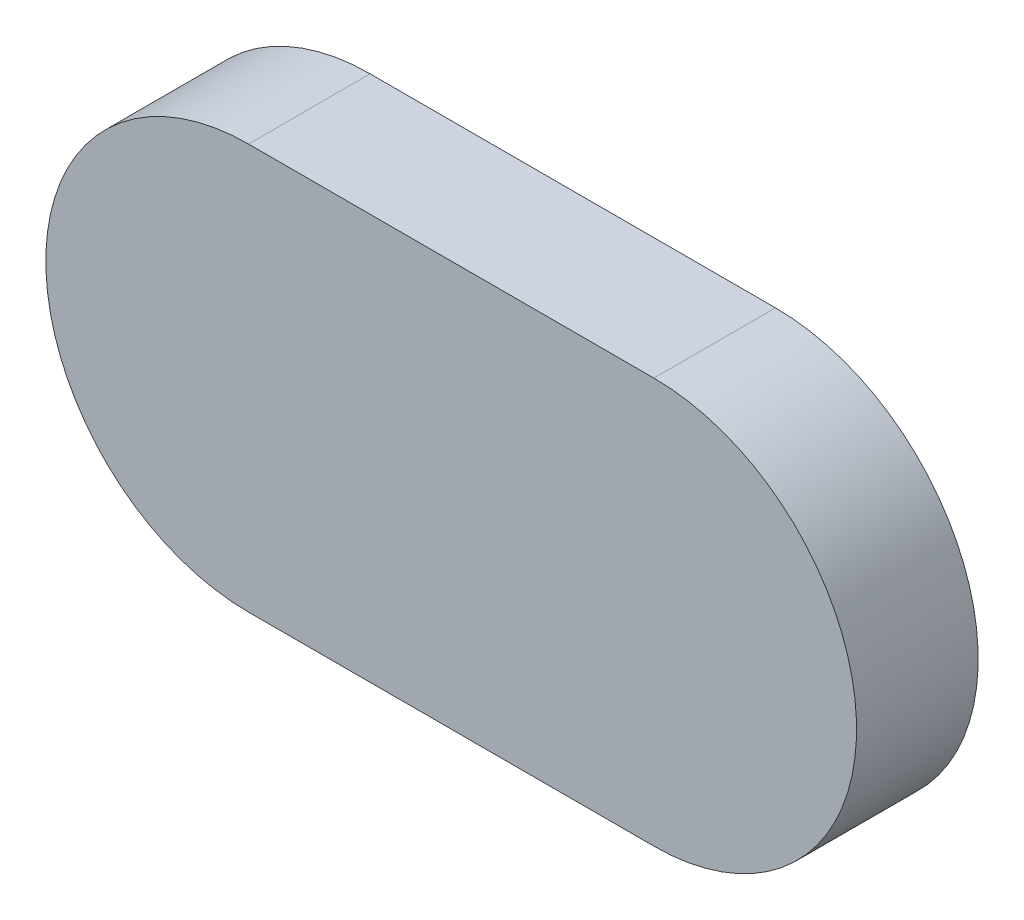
ISO-10303-21;
HEADER;
FILE_DESCRIPTION(('STEP AP214'),'2;1');
FILE_NAME('part.step','',(''),(''),'','','');
FILE_SCHEMA(('AUTOMOTIVE_DESIGN { 1 0 10303 214 1 1 1 1 }'));
ENDSEC;
DATA;
#1=APPLICATION_CONTEXT('core data for automotive mechanical design processes');
#2=APPLICATION_PROTOCOL_DEFINITION('international standard','automotive_design',2000,#1);
#3=PRODUCT_CONTEXT('',#1,'mechanical');
#4=PRODUCT('Part','Part','',(#3));
#5=PRODUCT_RELATED_PRODUCT_CATEGORY('part','',(#4));
#6=PRODUCT_DEFINITION_FORMATION('','',#4);
#7=PRODUCT_DEFINITION_CONTEXT('part definition',#1,'design');
#8=PRODUCT_DEFINITION('design','',#6,#7);
#9=PRODUCT_DEFINITION_SHAPE('','',#8);
#10=(LENGTH_UNIT() NAMED_UNIT(*) SI_UNIT(.MILLI.,.METRE.));
#11=(NAMED_UNIT(*) PLANE_ANGLE_UNIT() SI_UNIT($,.RADIAN.));
#12=(NAMED_UNIT(*) SI_UNIT($,.STERADIAN.) SOLID_ANGLE_UNIT());
#13=UNCERTAINTY_MEASURE_WITH_UNIT(LENGTH_MEASURE(1.E-05),#10,'distance_accuracy_value','');
#14=(GEOMETRIC_REPRESENTATION_CONTEXT(3) GLOBAL_UNCERTAINTY_ASSIGNED_CONTEXT((#13)) GLOBAL_UNIT_ASSIGNED_CONTEXT((#10,
#11,#12)) REPRESENTATION_CONTEXT('',''));
#15=CARTESIAN_POINT('',(0.,0.,0.));
#16=DIRECTION('',(0.,0.,1.));
#17=DIRECTION('',(1.,0.,0.));
#18=AXIS2_PLACEMENT_3D('',#15,#16,#17);
#19=CARTESIAN_POINT('',(0.,0.,1.5));
#20=DIRECTION('',(0.,0.,-1.));
#21=DIRECTION('',(-1.,0.,0.));
#22=AXIS2_PLACEMENT_3D('',#19,#20,#21);
#23=CYLINDRICAL_SURFACE('',#22,2.5);
#24=CARTESIAN_POINT('',(0.,0.,0.));
#25=DIRECTION('',(0.,0.,1.));
#26=DIRECTION('',(1.,0.,0.));
#27=AXIS2_PLACEMENT_3D('',#24,#25,#26);
#28=CIRCLE('',#27,2.5);
#29=CARTESIAN_POINT('',(0.,2.5,0.));
#30=VERTEX_POINT('',#29);
#31=CARTESIAN_POINT('',(0.,-2.5,0.));
#32=VERTEX_POINT('',#31);
#33=EDGE_CURVE('E106',#30,#32,#28,.T.);
#34=ORIENTED_EDGE('',*,*,#33,.T.);
#35=DIRECTION('',(0.,0.,-1.));
#36=VECTOR('',#35,1.);
#37=CARTESIAN_POINT('',(0.,-2.5,1.5));
#38=LINE('',#37,#36);
#39=CARTESIAN_POINT('',(0.,-2.5,1.5));
#40=VERTEX_POINT('',#39);
#41=EDGE_CURVE('E11',#40,#32,#38,.T.);
#42=ORIENTED_EDGE('',*,*,#41,.F.);
#43=CARTESIAN_POINT('',(0.,0.,1.5));
#44=DIRECTION('',(0.,0.,1.));
#45=DIRECTION('',(1.,0.,0.));
#46=AXIS2_PLACEMENT_3D('',#43,#44,#45);
#47=CIRCLE('',#46,2.5);
#48=CARTESIAN_POINT('',(0.,2.5,1.5));
#49=VERTEX_POINT('',#48);
#50=EDGE_CURVE('E94',#49,#40,#47,.T.);
#51=ORIENTED_EDGE('',*,*,#50,.F.);
#52=DIRECTION('',(0.,0.,-1.));
#53=VECTOR('',#52,1.);
#54=CARTESIAN_POINT('',(0.,2.5,1.5));
#55=LINE('',#54,#53);
#56=EDGE_CURVE('E102',#49,#30,#55,.T.);
#57=ORIENTED_EDGE('',*,*,#56,.T.);
#58=EDGE_LOOP('',(#34,#42,#51,#57));
#59=FACE_BOUND('',#58,.T.);
#60=ADVANCED_FACE('F43',(#59),#23,.T.);
#61=CARTESIAN_POINT('',(0.,-2.5,1.5));
#62=DIRECTION('',(0.,1.,0.));
#63=DIRECTION('',(0.,0.,1.));
#64=AXIS2_PLACEMENT_3D('',#61,#62,#63);
#65=PLANE('',#64);
#66=DIRECTION('',(1.,0.,0.));
#67=VECTOR('',#66,1.);
#68=CARTESIAN_POINT('',(0.,-2.5,0.));
#69=LINE('',#68,#67);
#70=CARTESIAN_POINT('',(5.,-2.5,0.));
#71=VERTEX_POINT('',#70);
#72=EDGE_CURVE('E98',#32,#71,#69,.T.);
#73=ORIENTED_EDGE('',*,*,#72,.T.);
#74=DIRECTION('',(0.,0.,-1.));
#75=VECTOR('',#74,1.);
#76=CARTESIAN_POINT('',(5.,-2.5,1.5));
#77=LINE('',#76,#75);
#78=CARTESIAN_POINT('',(5.,-2.5,1.5));
#79=VERTEX_POINT('',#78);
#80=EDGE_CURVE('E51',#79,#71,#77,.T.);
#81=ORIENTED_EDGE('',*,*,#80,.F.);
#82=DIRECTION('',(1.,0.,0.));
#83=VECTOR('',#82,1.);
#84=CARTESIAN_POINT('',(0.,-2.5,1.5));
#85=LINE('',#84,#83);
#86=EDGE_CURVE('E89',#40,#79,#85,.T.);
#87=ORIENTED_EDGE('',*,*,#86,.F.);
#88=ORIENTED_EDGE('',*,*,#41,.T.);
#89=EDGE_LOOP('',(#73,#81,#87,#88));
#90=FACE_BOUND('',#89,.T.);
#91=ADVANCED_FACE('F97',(#90),#65,.F.);
#92=CARTESIAN_POINT('',(5.,0.,1.5));
#93=DIRECTION('',(0.,0.,-1.));
#94=DIRECTION('',(-1.,0.,0.));
#95=AXIS2_PLACEMENT_3D('',#92,#93,#94);
#96=CYLINDRICAL_SURFACE('',#95,2.5);
#97=CARTESIAN_POINT('',(5.,0.,0.));
#98=DIRECTION('',(0.,0.,1.));
#99=DIRECTION('',(1.,0.,0.));
#100=AXIS2_PLACEMENT_3D('',#97,#98,#99);
#101=CIRCLE('',#100,2.5);
#102=CARTESIAN_POINT('',(5.,2.5,0.));
#103=VERTEX_POINT('',#102);
#104=EDGE_CURVE('E76',#71,#103,#101,.T.);
#105=ORIENTED_EDGE('',*,*,#104,.T.);
#106=DIRECTION('',(0.,0.,-1.));
#107=VECTOR('',#106,1.);
#108=CARTESIAN_POINT('',(5.,2.5,1.5));
#109=LINE('',#108,#107);
#110=CARTESIAN_POINT('',(5.,2.5,1.5));
#111=VERTEX_POINT('',#110);
#112=EDGE_CURVE('E99',#111,#103,#109,.T.);
#113=ORIENTED_EDGE('',*,*,#112,.F.);
#114=CARTESIAN_POINT('',(5.,0.,1.5));
#115=DIRECTION('',(0.,0.,1.));
#116=DIRECTION('',(1.,0.,0.));
#117=AXIS2_PLACEMENT_3D('',#114,#115,#116);
#118=CIRCLE('',#117,2.5);
#119=EDGE_CURVE('E92',#79,#111,#118,.T.);
#120=ORIENTED_EDGE('',*,*,#119,.F.);
#121=ORIENTED_EDGE('',*,*,#80,.T.);
#122=EDGE_LOOP('',(#105,#113,#120,#121));
#123=FACE_BOUND('',#122,.T.);
#124=ADVANCED_FACE('F100',(#123),#96,.T.);
#125=CARTESIAN_POINT('',(0.,2.5,1.5));
#126=DIRECTION('',(0.,-1.,0.));
#127=DIRECTION('',(0.,0.,-1.));
#128=AXIS2_PLACEMENT_3D('',#125,#126,#127);
#129=PLANE('',#128);
#130=DIRECTION('',(-1.,0.,0.));
#131=VECTOR('',#130,1.);
#132=CARTESIAN_POINT('',(0.,2.5,0.));
#133=LINE('',#132,#131);
#134=EDGE_CURVE('E82',#103,#30,#133,.T.);
#135=ORIENTED_EDGE('',*,*,#134,.T.);
#136=ORIENTED_EDGE('',*,*,#56,.F.);
#137=DIRECTION('',(-1.,0.,0.));
#138=VECTOR('',#137,1.);
#139=CARTESIAN_POINT('',(0.,2.5,1.5));
#140=LINE('',#139,#138);
#141=EDGE_CURVE('E59',#111,#49,#140,.T.);
#142=ORIENTED_EDGE('',*,*,#141,.F.);
#143=ORIENTED_EDGE('',*,*,#112,.T.);
#144=EDGE_LOOP('',(#135,#136,#142,#143));
#145=FACE_BOUND('',#144,.T.);
#146=ADVANCED_FACE('F113',(#145),#129,.F.);
#147=CARTESIAN_POINT('',(0.,0.,1.5));
#148=DIRECTION('',(0.,0.,1.));
#149=DIRECTION('',(1.,0.,0.));
#150=AXIS2_PLACEMENT_3D('',#147,#148,#149);
#151=PLANE('',#150);
#152=ORIENTED_EDGE('',*,*,#50,.T.);
#153=ORIENTED_EDGE('',*,*,#86,.T.);
#154=ORIENTED_EDGE('',*,*,#119,.T.);
#155=ORIENTED_EDGE('',*,*,#141,.T.);
#156=EDGE_LOOP('',(#152,#153,#154,#155));
#157=FACE_BOUND('',#156,.T.);
#158=ADVANCED_FACE('F90',(#157),#151,.T.);
#159=CARTESIAN_POINT('',(0.,0.,0.));
#160=DIRECTION('',(0.,0.,1.));
#161=DIRECTION('',(1.,0.,0.));
#162=AXIS2_PLACEMENT_3D('',#159,#160,#161);
#163=PLANE('',#162);
#164=ORIENTED_EDGE('',*,*,#33,.F.);
#165=ORIENTED_EDGE('',*,*,#134,.F.);
#166=ORIENTED_EDGE('',*,*,#104,.F.);
#167=ORIENTED_EDGE('',*,*,#72,.F.);
#168=EDGE_LOOP('',(#164,#165,#166,#167));
#169=FACE_BOUND('',#168,.T.);
#170=ADVANCED_FACE('F116',(#169),#163,.F.);
#171=CLOSED_SHELL('',(#60,#91,#124,#146,#158,#170));
#172=MANIFOLD_SOLID_BREP('B2',#171);
#173=ADVANCED_BREP_SHAPE_REPRESENTATION('',(#18,#172),#14);
#174=SHAPE_DEFINITION_REPRESENTATION(#9,#173);
ENDSEC;
END-ISO-10303-21;
